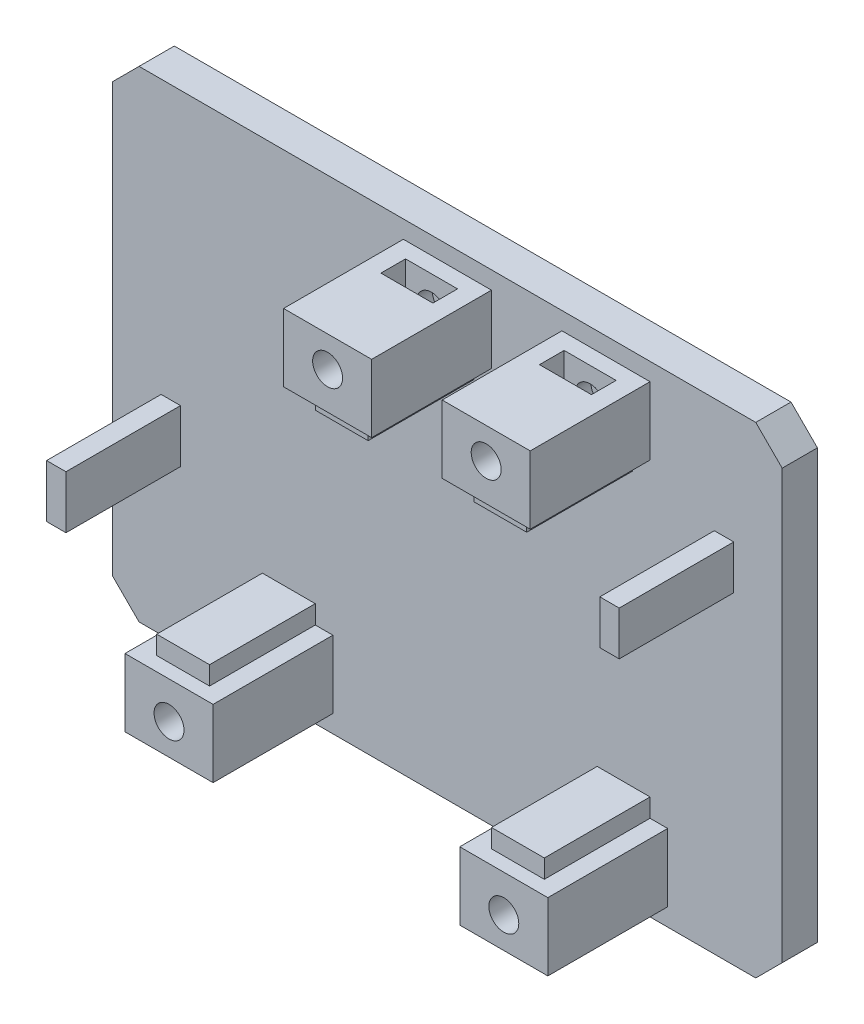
from build123d import *

# Parameters (mm, degrees)
FLAT_FLOOR_4MM_DEPTH                    = 4
EDGE_PEDESTAL_1_BAND_1_START            = 4
SKETCH_2_W                              = 10
SKETCH_2_H                              = 7.7
SKETCH_2_R                              = 1.7
EDGE_PEDESTAL_1_BAND_1_DEPTH            = 1.8
EDGE_PEDESTAL_1_BAND_2_START            = 5.8
EDGE_PEDESTAL_1_BAND_2_DEPTH            = 2.8
EDGE_PEDESTAL_1_BAND_3_START            = 8.6
SKETCH_4_W                              = 10
SKETCH_4_H                              = 7.7
SKETCH_4_R                              = 1.7
EDGE_PEDESTAL_1_BAND_3_DEPTH            = 9
EDGE_PEDESTAL_2_BAND_1_START            = 4
SKETCH_5_W                              = 10
SKETCH_5_H                              = 7.7
SKETCH_5_R                              = 1.7
EDGE_PEDESTAL_2_BAND_1_DEPTH            = 1.8
EDGE_PEDESTAL_2_BAND_2_START            = 5.8
EDGE_PEDESTAL_2_BAND_2_DEPTH            = 2.8
EDGE_PEDESTAL_2_BAND_3_START            = 8.6
SKETCH_7_W                              = 10
SKETCH_7_H                              = 7.7
SKETCH_7_R                              = 1.7
EDGE_PEDESTAL_2_BAND_3_DEPTH            = 9
EDGE_PEDESTAL_3_BAND_1_START            = 4
SKETCH_8_W                              = 10
SKETCH_8_H                              = 7.7
SKETCH_8_R                              = 1.7
EDGE_PEDESTAL_3_BAND_1_DEPTH            = 1.8
EDGE_PEDESTAL_3_BAND_2_START            = 5.8
EDGE_PEDESTAL_3_BAND_2_DEPTH            = 2.8
EDGE_PEDESTAL_3_BAND_3_START            = 8.6
SKETCH_10_W                             = 10
SKETCH_10_H                             = 7.7
SKETCH_10_R                             = 1.7
EDGE_PEDESTAL_3_BAND_3_DEPTH            = 9
EDGE_PEDESTAL_4_BAND_1_START            = 4
SKETCH_11_W                             = 10
SKETCH_11_H                             = 7.7
SKETCH_11_R                             = 1.7
EDGE_PEDESTAL_4_BAND_1_DEPTH            = 1.8
EDGE_PEDESTAL_4_BAND_2_START            = 5.8
EDGE_PEDESTAL_4_BAND_2_DEPTH            = 2.8
EDGE_PEDESTAL_4_BAND_3_START            = 8.6
SKETCH_13_W                             = 10
SKETCH_13_H                             = 7.7
SKETCH_13_R                             = 1.7
EDGE_PEDESTAL_4_BAND_3_DEPTH            = 9
FOUR_COMPONENT_FREE_EDGE_SUPPORTS_START = 4
SKETCH_14_W                             = 6
SKETCH_14_H                             = 2.4
FOUR_COMPONENT_FREE_EDGE_SUPPORTS_DEPTH = 12
LOW_SIDE_STOPS_OUTSIDE_PCB_START        = 4
SKETCH_15_W                             = 2.2
SKETCH_15_H                             = 6
SKETCH_15_H_2                           = 5
LOW_SIDE_STOPS_OUTSIDE_PCB_DEPTH        = 13


with BuildPart() as part:
    # Sketch 1 → Flat_floor_4mm (new body)
    with BuildSketch(Plane.XY):
        Polygon((-5, -44.619), (65, -44.619), (68, -41.619), (68, 7), (65, 10), (-5, 10), (-8, 7), (-8, -41.619), align=None)
    extrude(amount=FLAT_FLOOR_4MM_DEPTH)

    # Sketch 2 → Edge_pedestal_1_band_1 (add)
    with BuildSketch(Plane.XY.offset(EDGE_PEDESTAL_1_BAND_1_START)):
        with Locations((30, 4.15)):
            Rectangle(SKETCH_2_W, SKETCH_2_H)
        with Locations((30, 4.5)):
            Circle(SKETCH_2_R, mode=Mode.SUBTRACT)
    extrude(amount=EDGE_PEDESTAL_1_BAND_1_DEPTH)

    # Sketch 3 → Edge_pedestal_1_band_2 (add)
    with BuildSketch(Plane.XY.offset(EDGE_PEDESTAL_1_BAND_2_START)):
        Polygon((25, 0.3), (35, 0.3), (35, 8), (32.95, 8), (32.95, 1), (27.05, 1), (27.05, 8), (25, 8), align=None)
    extrude(amount=EDGE_PEDESTAL_1_BAND_2_DEPTH)

    # Sketch 4 → Edge_pedestal_1_band_3 (add)
    with BuildSketch(Plane.XY.offset(EDGE_PEDESTAL_1_BAND_3_START)):
        with Locations((30, 4.15)):
            Rectangle(SKETCH_4_W, SKETCH_4_H)
        with Locations((30, 4.5)):
            Circle(SKETCH_4_R, mode=Mode.SUBTRACT)
    extrude(amount=EDGE_PEDESTAL_1_BAND_3_DEPTH)

    # Sketch 5 → Edge_pedestal_2_band_1 (add)
    with BuildSketch(Plane.XY.offset(EDGE_PEDESTAL_2_BAND_1_START)):
        with Locations((48, 4.15)):
            Rectangle(SKETCH_5_W, SKETCH_5_H)
        with Locations((48, 4.5)):
            Circle(SKETCH_5_R, mode=Mode.SUBTRACT)
    extrude(amount=EDGE_PEDESTAL_2_BAND_1_DEPTH)

    # Sketch 6 → Edge_pedestal_2_band_2 (add)
    with BuildSketch(Plane.XY.offset(EDGE_PEDESTAL_2_BAND_2_START)):
        Polygon((43, 0.3), (53, 0.3), (53, 8), (50.95, 8), (50.95, 1), (45.05, 1), (45.05, 8), (43, 8), align=None)
    extrude(amount=EDGE_PEDESTAL_2_BAND_2_DEPTH)

    # Sketch 7 → Edge_pedestal_2_band_3 (add)
    with BuildSketch(Plane.XY.offset(EDGE_PEDESTAL_2_BAND_3_START)):
        with Locations((48, 4.15)):
            Rectangle(SKETCH_7_W, SKETCH_7_H)
        with Locations((48, 4.5)):
            Circle(SKETCH_7_R, mode=Mode.SUBTRACT)
    extrude(amount=EDGE_PEDESTAL_2_BAND_3_DEPTH)

    # Sketch 8 → Edge_pedestal_3_band_1 (add)
    with BuildSketch(Plane.XY.offset(EDGE_PEDESTAL_3_BAND_1_START)):
        with Locations((12, -38.769)):
            Rectangle(SKETCH_8_W, SKETCH_8_H)
        with Locations((12, -39.119)):
            Circle(SKETCH_8_R, mode=Mode.SUBTRACT)
    extrude(amount=EDGE_PEDESTAL_3_BAND_1_DEPTH)

    # Sketch 9 → Edge_pedestal_3_band_2 (add)
    with BuildSketch(Plane.XY.offset(EDGE_PEDESTAL_3_BAND_2_START)):
        Polygon((7, -34.919), (17, -34.919), (17, -42.619), (14.95, -42.619), (14.95, -35.619), (9.05, -35.619), (9.05, -42.619), (7, -42.619), align=None)
    extrude(amount=EDGE_PEDESTAL_3_BAND_2_DEPTH)

    # Sketch 10 → Edge_pedestal_3_band_3 (add)
    with BuildSketch(Plane.XY.offset(EDGE_PEDESTAL_3_BAND_3_START)):
        with Locations((12, -38.769)):
            Rectangle(SKETCH_10_W, SKETCH_10_H)
        with Locations((12, -39.119)):
            Circle(SKETCH_10_R, mode=Mode.SUBTRACT)
    extrude(amount=EDGE_PEDESTAL_3_BAND_3_DEPTH)

    # Sketch 11 → Edge_pedestal_4_band_1 (add)
    with BuildSketch(Plane.XY.offset(EDGE_PEDESTAL_4_BAND_1_START)):
        with Locations((50, -38.769)):
            Rectangle(SKETCH_11_W, SKETCH_11_H)
        with Locations((50, -39.119)):
            Circle(SKETCH_11_R, mode=Mode.SUBTRACT)
    extrude(amount=EDGE_PEDESTAL_4_BAND_1_DEPTH)

    # Sketch 12 → Edge_pedestal_4_band_2 (add)
    with BuildSketch(Plane.XY.offset(EDGE_PEDESTAL_4_BAND_2_START)):
        Polygon((45, -34.919), (55, -34.919), (55, -42.619), (52.95, -42.619), (52.95, -35.619), (47.05, -35.619), (47.05, -42.619), (45, -42.619), align=None)
    extrude(amount=EDGE_PEDESTAL_4_BAND_2_DEPTH)

    # Sketch 13 → Edge_pedestal_4_band_3 (add)
    with BuildSketch(Plane.XY.offset(EDGE_PEDESTAL_4_BAND_3_START)):
        with Locations((50, -38.769)):
            Rectangle(SKETCH_13_W, SKETCH_13_H)
        with Locations((50, -39.119)):
            Circle(SKETCH_13_R, mode=Mode.SUBTRACT)
    extrude(amount=EDGE_PEDESTAL_4_BAND_3_DEPTH)

    # Sketch 14 → Four_component_free_edge_supports (add)
    with BuildSketch(Plane.XY.offset(FOUR_COMPONENT_FREE_EDGE_SUPPORTS_START)):
        with Locations((30, -0.6)):
            Rectangle(SKETCH_14_W, SKETCH_14_H)
        with Locations((48, -0.6)):
            Rectangle(SKETCH_14_W, SKETCH_14_H)
        with Locations((12, -34.019)):
            Rectangle(SKETCH_14_W, SKETCH_14_H)
        with Locations((50, -34.019)):
            Rectangle(SKETCH_14_W, SKETCH_14_H)
    extrude(amount=FOUR_COMPONENT_FREE_EDGE_SUPPORTS_DEPTH)

    # Sketch 15 → Low_side_stops_outside_PCB (add)
    with BuildSketch(Plane.XY.offset(LOW_SIDE_STOPS_OUTSIDE_PCB_START)):
        with Locations((-1.4, -24)):
            Rectangle(SKETCH_15_W, SKETCH_15_H)
        with Locations((61.4, -5.5)):
            Rectangle(SKETCH_15_W, SKETCH_15_H_2)
    extrude(amount=LOW_SIDE_STOPS_OUTSIDE_PCB_DEPTH)


solid = part.part
